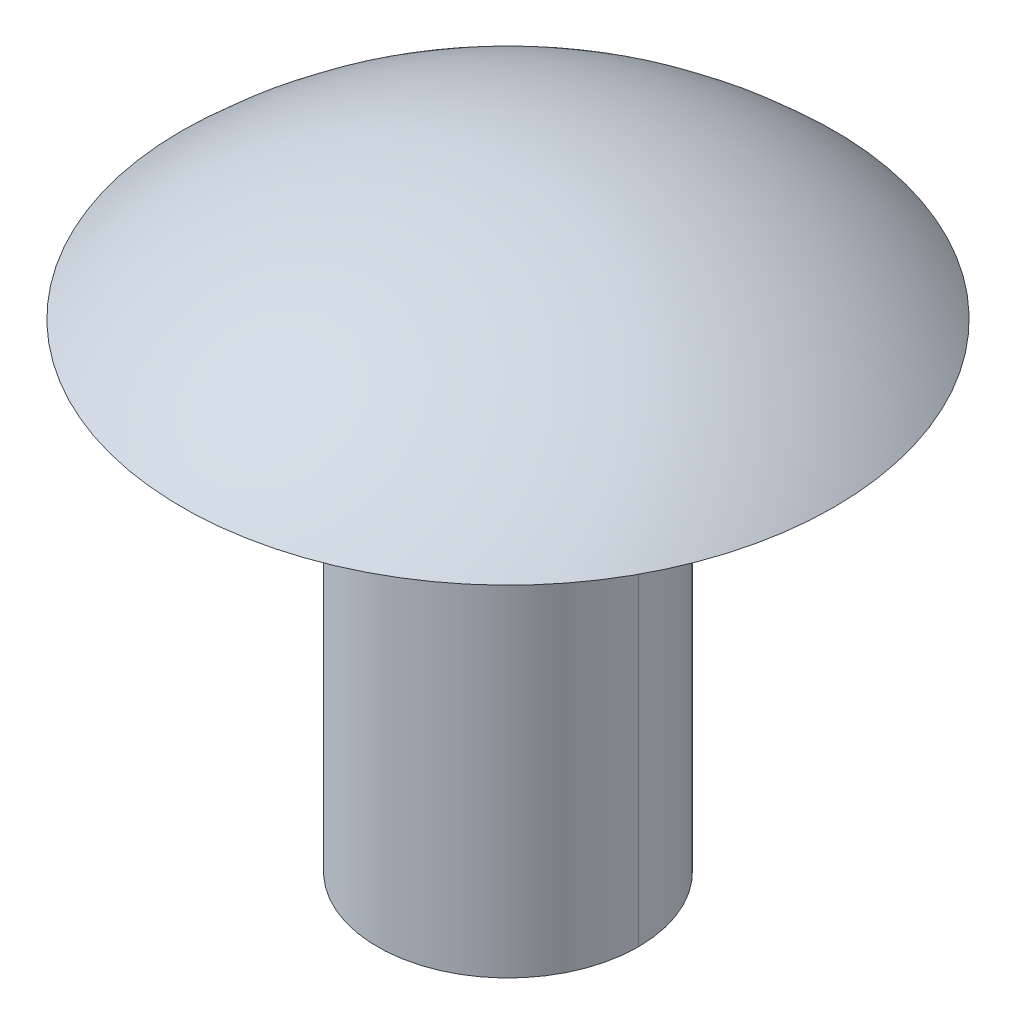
ISO-10303-21;
HEADER;
FILE_DESCRIPTION(('STEP AP214'),'2;1');
FILE_NAME('part.step','',(''),(''),'','','');
FILE_SCHEMA(('AUTOMOTIVE_DESIGN { 1 0 10303 214 1 1 1 1 }'));
ENDSEC;
DATA;
#1=APPLICATION_CONTEXT('core data for automotive mechanical design processes');
#2=APPLICATION_PROTOCOL_DEFINITION('international standard','automotive_design',2000,#1);
#3=PRODUCT_CONTEXT('',#1,'mechanical');
#4=PRODUCT('Part','Part','',(#3));
#5=PRODUCT_RELATED_PRODUCT_CATEGORY('part','',(#4));
#6=PRODUCT_DEFINITION_FORMATION('','',#4);
#7=PRODUCT_DEFINITION_CONTEXT('part definition',#1,'design');
#8=PRODUCT_DEFINITION('design','',#6,#7);
#9=PRODUCT_DEFINITION_SHAPE('','',#8);
#10=(LENGTH_UNIT() NAMED_UNIT(*) SI_UNIT(.MILLI.,.METRE.));
#11=(NAMED_UNIT(*) PLANE_ANGLE_UNIT() SI_UNIT($,.RADIAN.));
#12=(NAMED_UNIT(*) SI_UNIT($,.STERADIAN.) SOLID_ANGLE_UNIT());
#13=UNCERTAINTY_MEASURE_WITH_UNIT(LENGTH_MEASURE(1.E-05),#10,'distance_accuracy_value','');
#14=(GEOMETRIC_REPRESENTATION_CONTEXT(3) GLOBAL_UNCERTAINTY_ASSIGNED_CONTEXT((#13)) GLOBAL_UNIT_ASSIGNED_CONTEXT((#10,
#11,#12)) REPRESENTATION_CONTEXT('',''));
#15=CARTESIAN_POINT('',(0.,0.,0.));
#16=DIRECTION('',(0.,0.,1.));
#17=DIRECTION('',(1.,0.,0.));
#18=AXIS2_PLACEMENT_3D('',#15,#16,#17);
#19=CARTESIAN_POINT('',(0.,-17.4625,0.));
#20=DIRECTION('',(0.,1.,0.));
#21=DIRECTION('',(0.,0.,1.));
#22=AXIS2_PLACEMENT_3D('',#19,#20,#21);
#23=PLANE('',#22);
#24=DIRECTION('',(-1.,0.,0.));
#25=VECTOR('',#24,1.);
#26=CARTESIAN_POINT('',(0.,-17.4625,0.));
#27=LINE('',#26,#25);
#28=CARTESIAN_POINT('',(4.7625,-17.4625,0.));
#29=VERTEX_POINT('',#28);
#30=CARTESIAN_POINT('',(-4.7625,-17.4625,0.));
#31=VERTEX_POINT('',#30);
#32=EDGE_CURVE('E11',#29,#31,#27,.T.);
#33=ORIENTED_EDGE('',*,*,#32,.F.);
#34=CARTESIAN_POINT('',(0.,-17.4625,0.));
#35=DIRECTION('',(0.,1.,0.));
#36=DIRECTION('',(0.,0.,1.));
#37=AXIS2_PLACEMENT_3D('',#34,#35,#36);
#38=CIRCLE('',#37,4.7625);
#39=EDGE_CURVE('E76',#31,#29,#38,.T.);
#40=ORIENTED_EDGE('',*,*,#39,.F.);
#41=EDGE_LOOP('',(#33,#40));
#42=FACE_BOUND('',#41,.T.);
#43=ADVANCED_FACE('F39',(#42),#23,.F.);
#44=CARTESIAN_POINT('',(0.,0.,0.));
#45=DIRECTION('',(0.,1.,0.));
#46=DIRECTION('',(-1.,0.,0.));
#47=AXIS2_PLACEMENT_3D('',#44,#45,#46);
#48=PLANE('',#47);
#49=DIRECTION('',(-1.,0.,0.));
#50=VECTOR('',#49,1.);
#51=CARTESIAN_POINT('',(0.,0.,0.));
#52=LINE('',#51,#50);
#53=CARTESIAN_POINT('',(11.8999,0.,0.));
#54=VERTEX_POINT('',#53);
#55=CARTESIAN_POINT('',(4.7625,0.,0.));
#56=VERTEX_POINT('',#55);
#57=EDGE_CURVE('E49',#54,#56,#52,.T.);
#58=ORIENTED_EDGE('',*,*,#57,.F.);
#59=CARTESIAN_POINT('',(0.,0.,0.));
#60=DIRECTION('',(0.,1.,0.));
#61=DIRECTION('',(-1.,0.,0.));
#62=AXIS2_PLACEMENT_3D('',#59,#60,#61);
#63=CIRCLE('',#62,11.8999);
#64=CARTESIAN_POINT('',(-11.8999,0.,0.));
#65=VERTEX_POINT('',#64);
#66=EDGE_CURVE('E96',#65,#54,#63,.T.);
#67=ORIENTED_EDGE('',*,*,#66,.F.);
#68=CARTESIAN_POINT('',(-4.7625,0.,0.));
#69=VERTEX_POINT('',#68);
#70=EDGE_CURVE('E62',#69,#65,#52,.T.);
#71=ORIENTED_EDGE('',*,*,#70,.F.);
#72=CARTESIAN_POINT('',(0.,0.,0.));
#73=DIRECTION('',(0.,1.,0.));
#74=DIRECTION('',(0.,0.,1.));
#75=AXIS2_PLACEMENT_3D('',#72,#73,#74);
#76=CIRCLE('',#75,4.7625);
#77=EDGE_CURVE('E98',#69,#56,#76,.T.);
#78=ORIENTED_EDGE('',*,*,#77,.T.);
#79=EDGE_LOOP('',(#58,#67,#71,#78));
#80=FACE_BOUND('',#79,.T.);
#81=ADVANCED_FACE('F118',(#80),#48,.F.);
#82=CARTESIAN_POINT('',(0.,-17.4625,0.));
#83=DIRECTION('',(0.,1.,0.));
#84=DIRECTION('',(0.,0.,1.));
#85=AXIS2_PLACEMENT_3D('',#82,#83,#84);
#86=CYLINDRICAL_SURFACE('',#85,4.7625);
#87=ORIENTED_EDGE('',*,*,#77,.F.);
#88=DIRECTION('',(0.,1.,0.));
#89=VECTOR('',#88,1.);
#90=CARTESIAN_POINT('',(-4.7625,-17.4625,0.));
#91=LINE('',#90,#89);
#92=EDGE_CURVE('E90',#69,#31,#91,.F.);
#93=ORIENTED_EDGE('',*,*,#92,.T.);
#94=ORIENTED_EDGE('',*,*,#39,.T.);
#95=DIRECTION('',(0.,1.,0.));
#96=VECTOR('',#95,1.);
#97=CARTESIAN_POINT('',(4.7625,-17.4625,0.));
#98=LINE('',#97,#96);
#99=EDGE_CURVE('E43',#29,#56,#98,.T.);
#100=ORIENTED_EDGE('',*,*,#99,.T.);
#101=EDGE_LOOP('',(#87,#93,#94,#100));
#102=FACE_BOUND('',#101,.T.);
#103=ADVANCED_FACE('F91',(#102),#86,.T.);
#104=ORIENTED_EDGE('',*,*,#92,.F.);
#105=EDGE_CURVE('E86',#56,#69,#76,.T.);
#106=ORIENTED_EDGE('',*,*,#105,.F.);
#107=ORIENTED_EDGE('',*,*,#99,.F.);
#108=EDGE_CURVE('E85',#29,#31,#38,.T.);
#109=ORIENTED_EDGE('',*,*,#108,.T.);
#110=EDGE_LOOP('',(#104,#106,#107,#109));
#111=FACE_BOUND('',#110,.T.);
#112=ADVANCED_FACE('F41',(#111),#86,.T.);
#113=ORIENTED_EDGE('',*,*,#108,.F.);
#114=ORIENTED_EDGE('',*,*,#32,.T.);
#115=EDGE_LOOP('',(#113,#114));
#116=FACE_BOUND('',#115,.T.);
#117=ADVANCED_FACE('F93',(#116),#23,.F.);
#118=CARTESIAN_POINT('',(0.,-12.5317929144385,0.));
#119=DIRECTION('',(0.,1.,0.));
#120=DIRECTION('',(1.,0.,0.));
#121=AXIS2_PLACEMENT_3D('',#118,#119,#120);
#122=SPHERICAL_SURFACE('',#121,17.2815929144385);
#123=ORIENTED_EDGE('',*,*,#66,.T.);
#124=EDGE_CURVE('E114',#54,#65,#63,.T.);
#125=ORIENTED_EDGE('',*,*,#124,.T.);
#126=EDGE_LOOP('',(#123,#125));
#127=FACE_BOUND('',#126,.T.);
#128=ADVANCED_FACE('F117',(#127),#122,.T.);
#129=ORIENTED_EDGE('',*,*,#124,.F.);
#130=ORIENTED_EDGE('',*,*,#57,.T.);
#131=ORIENTED_EDGE('',*,*,#105,.T.);
#132=ORIENTED_EDGE('',*,*,#70,.T.);
#133=EDGE_LOOP('',(#129,#130,#131,#132));
#134=FACE_BOUND('',#133,.T.);
#135=ADVANCED_FACE('F113',(#134),#48,.F.);
#136=CLOSED_SHELL('',(#43,#81,#103,#112,#117,#128,#135));
#137=MANIFOLD_SOLID_BREP('B2',#136);
#138=ADVANCED_BREP_SHAPE_REPRESENTATION('',(#18,#137),#14);
#139=SHAPE_DEFINITION_REPRESENTATION(#9,#138);
ENDSEC;
END-ISO-10303-21;
